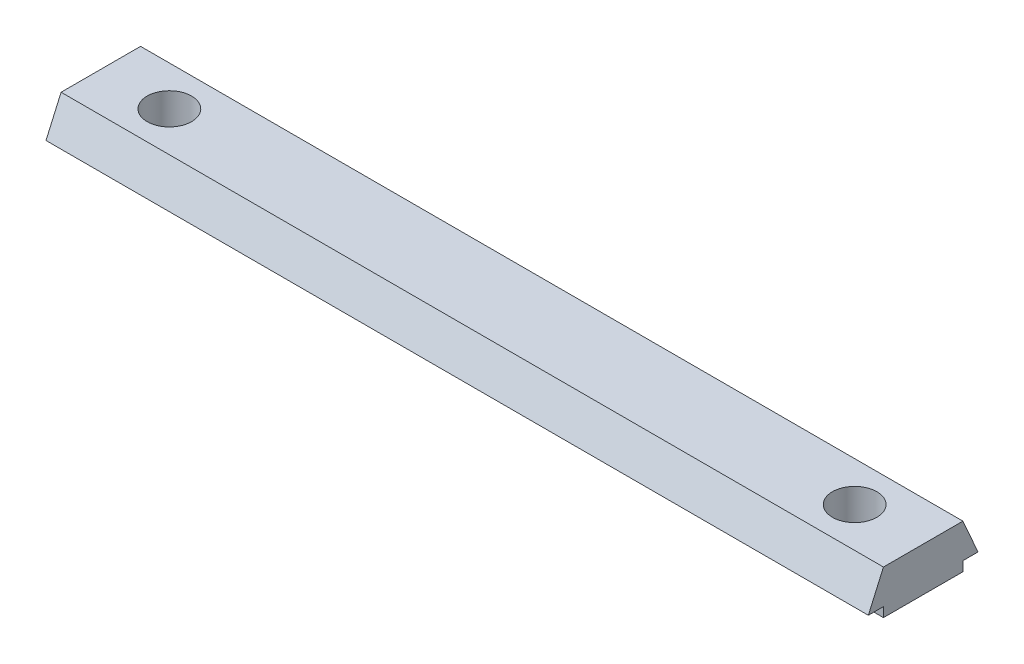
from build123d import *

# Parameters (mm, degrees)
BOSS_EXTRUDE1_DEPTH = 60
TAPPED_HOLE1_D      = 3.242
LPATTERN1_COUNT     = 2
LPATTERN1_PITCH     = 50


with BuildPart() as part:
    # Sketch1 → Boss-Extrude1 (new body)
    with BuildSketch(Plane(origin=(0, 0, 0), x_dir=(0, 0, -1), z_dir=(1, 0, 0))):
        Polygon((-2.9, 0), (2.9, 0), (2.9, 0.7), (4, 0.7), (2.9, 3.2), (-2.9, 3.2), (-4, 0.7), (-2.9, 0.7), align=None)
    extrude(amount=BOSS_EXTRUDE1_DEPTH)

    # Tapped Hole1 (through all)
    with Locations(Plane(origin=(0, 3.2, 0), x_dir=(1, 0, 0), z_dir=(0, 1, 0))):
        with Locations((5, 0)):
            tapped_hole1 = Hole(TAPPED_HOLE1_D / 2)

    # LPattern1: Tapped Hole1 ×2
    with Locations(*[(i * LPATTERN1_PITCH, 0, 0) for i in range(1, LPATTERN1_COUNT)]):
        add(tapped_hole1, mode=Mode.SUBTRACT)


solid = part.part
